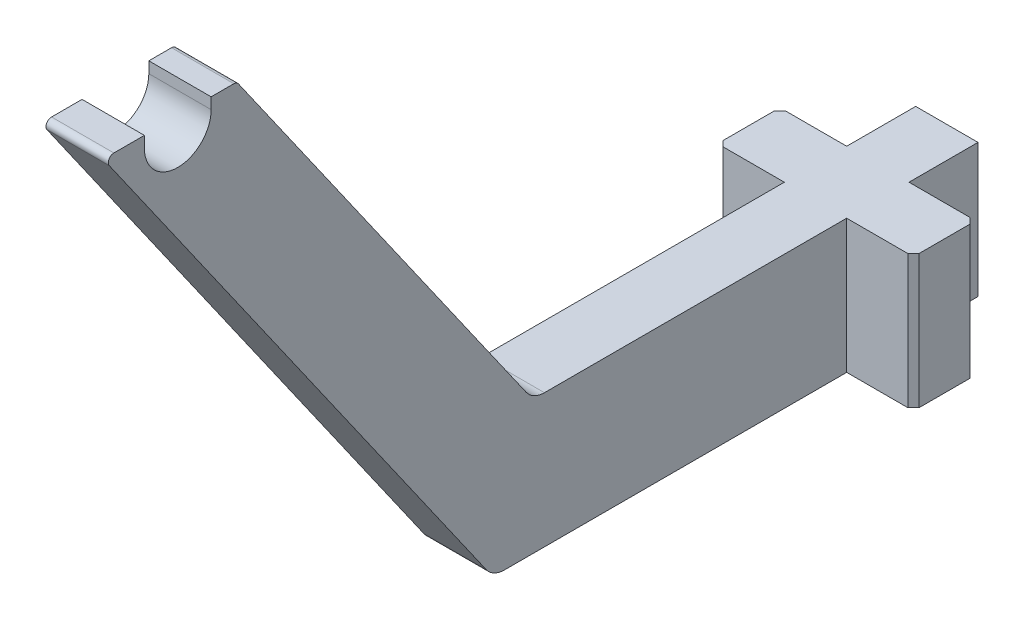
from build123d import *

# Parameters (mm, degrees)
EXTRUDE_1_DEPTH     = 1.4
SKETCH_2_W          = 3
SKETCH_2_H          = 2.8
EXTRUDE_2_DEPTH     = 6
CUT_EXTRUDE_1_DEPTH = 47.940813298
FILLET_1_R          = 1
FILLET_2_R          = 0.25
CHAMFER_1_SIZE      = 0.25


with BuildPart() as part:
    # Sketch 1 → Extrude 1 (new, symmetric)
    with BuildSketch(Plane(origin=(0, 0, 0), x_dir=(0, 0, -1), z_dir=(1, 0, 0))):
        Polygon((0, 0), (0, 6), (-20, 6), (-33.303943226, 25), (-39.303943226, 25), (-21.798754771, 0), align=None)
    extrude(amount=EXTRUDE_1_DEPTH, both=True)

    # Sketch 2 → Extrude 2 (add)
    with BuildSketch(Plane(origin=(0, 6, 0), x_dir=(1, 0, 0), z_dir=(0, 1, 0))):
        with Locations((-2.9, -4.5)):
            Rectangle(SKETCH_2_W, SKETCH_2_H)
        with Locations((2.9, -4.5)):
            Rectangle(SKETCH_2_W, SKETCH_2_H)
    extrude(amount=-EXTRUDE_2_DEPTH)

    # Sketch 3 → Cut-Extrude 1 (cut, through all)
    with BuildSketch(Plane.ZY.offset(1.4)):
        with BuildLine():
            Line((34.453839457, 24.5), (34.453839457, 25))
            Line((34.453839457, 25), (37.453839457, 25))
            Line((37.453839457, 25), (37.453839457, 24.5))
            ThreePointArc((37.453839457, 24.5), (35.953839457, 23), (34.453839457, 24.5))
        make_face()
    extrude(amount=-CUT_EXTRUDE_1_DEPTH, mode=Mode.SUBTRACT)

    # Fillet 1
    fillet_1_edges = [part.edges().sort_by_distance(p)[0] for p in [
        (0, 6, 20),
        (0, 0, 21.798754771),
    ]]
    fillet(fillet_1_edges, radius=FILLET_1_R)

    # Fillet 2
    fillet_2_edges = [part.edges().sort_by_distance(p)[0] for p in [
        (0, 25, 39.303943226),
        (0, 25, 33.303943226),
    ]]
    fillet(fillet_2_edges, radius=FILLET_2_R)

    # Chamfer 1
    chamfer_1_edges = [part.edges().sort_by_distance(p)[0] for p in [
        (-4.4, 3, 5.9),
        (-4.4, 3, 3.1),
        (4.4, 3, 5.9),
        (4.4, 3, 3.1),
    ]]
    chamfer(chamfer_1_edges, length=CHAMFER_1_SIZE)


solid = part.part
